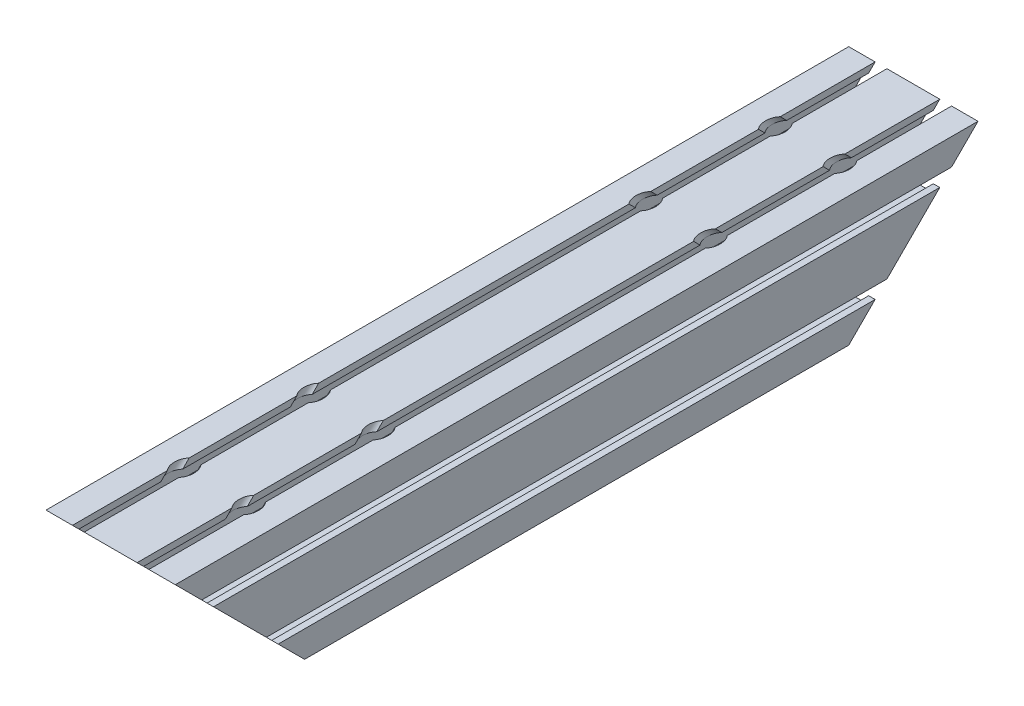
from build123d import *

# Parameters (mm, degrees)
EXTRUDE1_DEPTH      = 279.4
EXTRUDE1_DEPTH_BACK = 279.4
SKETCH1_R           = 5.85
SKETCH1_R_2         = 3.75
EXTRUDE2_DEPTH      = 297.966934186
SKETCH3_R           = 4.25
EXTRUDE3_DEPTH      = 431.842662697
SKETCH4_R           = 6.75
EXTRUDE4_DEPTH      = 279.4


with BuildPart() as part:
    # Sketch1 → Extrude1 (new, two sides: drawn at the far end of the back side and taken through both)
    with BuildSketch(Plane.XY.offset(-EXTRUDE1_DEPTH_BACK)):
        Polygon((40.5, 26.6), (45, 26.6), (45, 45), (26.599999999, 45), (26.599999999, 40.5), (29.299999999, 40.5), (29.299999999, 32), (26.999999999, 29.7), (17.999999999, 29.7), (15.699999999, 32), (15.699999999, 40.5), (18.399999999, 40.5), (18.399999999, 45), (-18.4, 45), (-18.4, 40.5), (-15.7, 40.5), (-15.7, 32), (-18, 29.7), (-27, 29.7), (-29.3, 32), (-29.3, 40.5), (-26.6, 40.5), (-26.6, 45), (-45, 45), (-45, 26.6), (-40.5, 26.6), (-40.5, 29.3), (-32, 29.3), (-29.7, 27), (-29.7, 18), (-32, 15.7), (-40.5, 15.7), (-40.5, 18.4), (-45, 18.4), (-45, -18.4), (-40.5, -18.4), (-40.5, -15.7), (-32, -15.7), (-29.7, -18), (-29.7, -27), (-32, -29.3), (-40.5, -29.3), (-40.5, -26.6), (-45, -26.6), (-45, -45), (-26.6, -45), (-26.6, -40.5), (-29.3, -40.5), (-29.3, -32), (-27, -29.7), (-18, -29.7), (-15.7, -32), (-15.7, -40.5), (-18.4, -40.5), (-18.4, -45), (18.4, -45), (18.4, -40.5), (15.7, -40.5), (15.7, -32), (18, -29.7), (27, -29.7), (29.3, -32), (29.3, -40.5), (26.6, -40.5), (26.6, -45), (45, -45), (45, -26.6), (40.5, -26.6), (40.5, -29.3), (32, -29.3), (29.7, -27), (29.7, -18), (32, -15.7), (40.5, -15.7), (40.5, -18.4), (45, -18.4), (45, 18.4), (40.5, 18.4), (40.5, 15.7), (32, 15.7), (29.7, 18), (29.7, 27), (32, 29.3), (40.5, 29.3), align=None)
        with Locations((37.15, 37.15)):
            Circle(SKETCH1_R, mode=Mode.SUBTRACT)
        with Locations((22.500001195, 22.500001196)):
            Circle(SKETCH1_R_2, mode=Mode.SUBTRACT)
        with Locations((22.500001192, -22.500000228)):
            Circle(SKETCH1_R_2, mode=Mode.SUBTRACT)
        with Locations((37.15, -37.15)):
            Circle(SKETCH1_R, mode=Mode.SUBTRACT)
        with Locations((-37.15, -37.15)):
            Circle(SKETCH1_R, mode=Mode.SUBTRACT)
        with Locations((-22.49999928, -22.500000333)):
            Circle(SKETCH1_R_2, mode=Mode.SUBTRACT)
        with Locations((-22.499999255, 22.500000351)):
            Circle(SKETCH1_R_2, mode=Mode.SUBTRACT)
        with Locations((-37.15, 37.15)):
            Circle(SKETCH1_R, mode=Mode.SUBTRACT)
        with BuildLine():
            Line((-29.241484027, -13.700012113), (-40.999999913, -13.700012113))
            ThreePointArc((-40.999999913, -13.700012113), (-41.707106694, -13.407118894), (-41.999999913, -12.700012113))
            Line((-41.999999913, -12.700012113), (-41.999999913, 12.700012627))
            ThreePointArc((-41.999999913, 12.700012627), (-41.707106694, 13.407119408), (-40.999999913, 13.700012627))
            Line((-40.999999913, 13.700012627), (-29.241482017, 13.700012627))
            ThreePointArc((-29.241482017, 13.700012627), (-29.00173925, 13.714433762), (-28.765453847, 13.75748921))
            Line((-28.765453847, 13.75748921), (-20.833900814, 15.701168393))
            ThreePointArc((-20.833900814, 15.701168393), (-17.550251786, 17.550252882), (-15.701167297, 20.83390191))
            Line((-15.701167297, 20.83390191), (-13.757487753, 28.765456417))
            ThreePointArc((-13.757487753, 28.765456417), (-13.714432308, 29.001741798), (-13.70001117, 29.241484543))
            Line((-13.70001117, 29.241484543), (-13.70001117, 41.000001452))
            ThreePointArc((-13.70001117, 41.000001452), (-13.407117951, 41.707108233), (-12.70001117, 42.000001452))
            Line((-12.70001117, 42.000001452), (12.700013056, 42.000001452))
            ThreePointArc((12.700013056, 42.000001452), (13.407119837, 41.707108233), (13.700013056, 41.000001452))
            Line((13.700013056, 41.000001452), (13.700013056, 29.24148561))
            ThreePointArc((13.700013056, 29.24148561), (13.714434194, 29.001742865), (13.757489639, 28.765457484))
            Line((13.757489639, 28.765457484), (15.701169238, 20.833902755))
            ThreePointArc((15.701169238, 20.833902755), (17.550253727, 17.550253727), (20.833902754, 15.701169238))
            Line((20.833902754, 15.701169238), (28.765459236, 13.75748921))
            ThreePointArc((28.765459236, 13.75748921), (29.001744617, 13.714433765), (29.241487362, 13.700012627))
            Line((29.241487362, 13.700012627), (41.000000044, 13.700012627))
            ThreePointArc((41.000000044, 13.700012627), (41.707106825, 13.407119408), (42.000000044, 12.700012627))
            Line((42.000000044, 12.700012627), (42.000000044, -12.700012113))
            ThreePointArc((42.000000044, -12.700012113), (41.707106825, -13.407118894), (41.000000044, -13.700012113))
            Line((41.000000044, -13.700012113), (29.241485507, -13.700012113))
            ThreePointArc((29.241485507, -13.700012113), (29.001742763, -13.714433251), (28.765457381, -13.757488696))
            Line((28.765457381, -13.757488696), (20.833902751, -15.70116827))
            ThreePointArc((20.833902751, -15.70116827), (17.550253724, -17.550252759), (15.701169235, -20.833901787))
            Line((15.701169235, -20.833901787), (13.757489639, -28.765456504))
            ThreePointArc((13.757489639, -28.765456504), (13.714434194, -29.001741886), (13.700013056, -29.24148463))
            Line((13.700013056, -29.24148463), (13.700013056, -41.000000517))
            ThreePointArc((13.700013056, -41.000000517), (13.407119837, -41.707107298), (12.700013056, -42.000000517))
            Line((12.700013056, -42.000000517), (-12.70001117, -42.000000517))
            ThreePointArc((-12.70001117, -42.000000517), (-13.407117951, -41.707107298), (-13.70001117, -41.000000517))
            Line((-13.70001117, -41.000000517), (-13.70001117, -29.24148463))
            ThreePointArc((-13.70001117, -29.24148463), (-13.714432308, -29.001741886), (-13.757487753, -28.765456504))
            Line((-13.757487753, -28.765456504), (-15.701167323, -20.833901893))
            ThreePointArc((-15.701167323, -20.833901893), (-17.550251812, -17.550252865), (-20.833900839, -15.701168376))
            Line((-20.833900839, -15.701168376), (-28.765455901, -13.757488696))
            ThreePointArc((-28.765455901, -13.757488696), (-29.001741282, -13.714433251), (-29.241484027, -13.700012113))
        make_face(mode=Mode.SUBTRACT)
    extrude(amount=EXTRUDE1_DEPTH + EXTRUDE1_DEPTH_BACK)

    # Sketch2 → Extrude2 (cut, through all)
    with BuildSketch(Plane(origin=(45, 0, 0), x_dir=(0, 0, -1), z_dir=(1, 0, 0))):
        Polygon((-279.4, 45), (-189.4, -45), (-279.4, -45), align=None)
        Polygon((279.4, 45), (279.4, -45), (189.4, -45), align=None)
    extrude(amount=-EXTRUDE2_DEPTH, mode=Mode.SUBTRACT)

    # Sketch3 → Extrude3 (cut, through all)
    with BuildSketch(Plane(origin=(0, -117.2, 117.2), x_dir=(1, 0, 0), z_dir=(0, -0.707106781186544, 0.7071067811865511))):
        with Locations(Location((-22.5, 177.315439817, 0), (0, 0, 293.080456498))):
            Circle(SKETCH3_R)
        with Locations(Location((22.5, 177.315439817, 0), (0, 0, 246.919572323))):
            Circle(SKETCH3_R)
        with Locations(Location((-22.5, 113.561439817, 0), (0, 0, 293.080455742))):
            Circle(SKETCH3_R)
        with Locations(Location((22.5, 113.561439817, 0), (0, 0, 246.919552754))):
            Circle(SKETCH3_R)
    extrude3 = extrude(amount=-EXTRUDE3_DEPTH, mode=Mode.SUBTRACT)

    # Sketch4 → Extrude4 (cut)
    with BuildSketch(Plane(origin=(0, -101.933564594, 101.933564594), x_dir=(1, 0, 0), z_dir=(0, -0.707106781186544, 0.7071067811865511))):
        with Locations(Location((-22.5, 113.561439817, 0), (0, 0, 270))):
            Circle(SKETCH4_R)
        with Locations(Location((22.5, 113.561439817, 0), (0, 0, 270))):
            Circle(SKETCH4_R)
        with Locations(Location((-22.5, 177.315439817, 0), (0, 0, 270))):
            Circle(SKETCH4_R)
        with Locations(Location((22.5, 177.315439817, 0), (0, 0, 270))):
            Circle(SKETCH4_R)
    extrude4 = extrude(amount=-EXTRUDE4_DEPTH, mode=Mode.SUBTRACT)

    # Mirror1: Extrude3, Extrude4 across plane
    add(extrude3.mirror(Plane.XY), mode=Mode.SUBTRACT)
    add(extrude4.mirror(Plane.XY), mode=Mode.SUBTRACT)


solid = part.part
